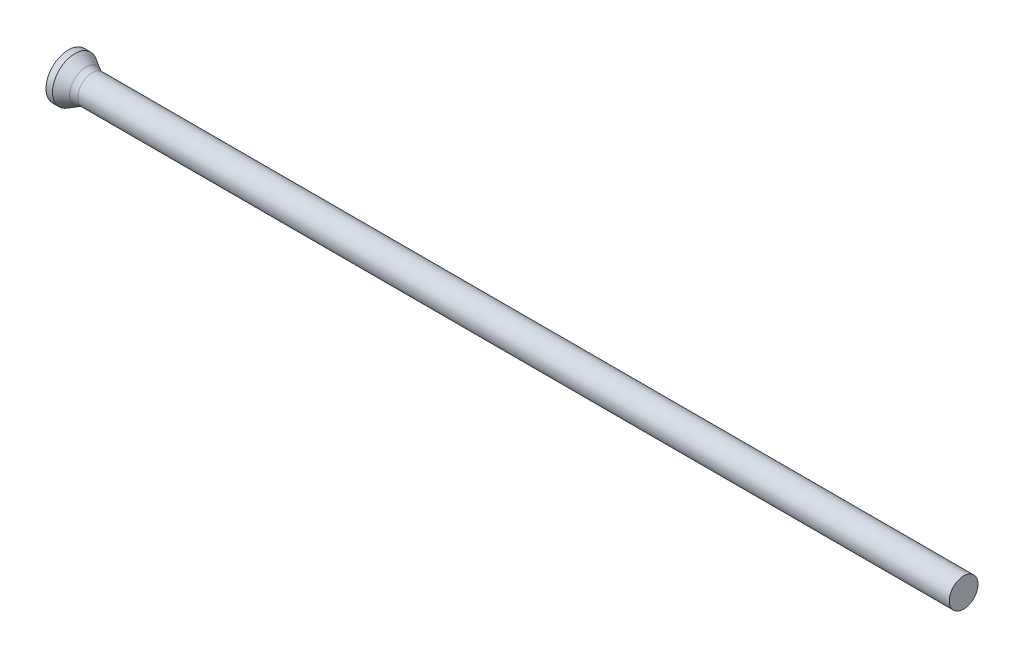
ISO-10303-21;
HEADER;
FILE_DESCRIPTION(('STEP AP214'),'2;1');
FILE_NAME('part.step','',(''),(''),'','','');
FILE_SCHEMA(('AUTOMOTIVE_DESIGN { 1 0 10303 214 1 1 1 1 }'));
ENDSEC;
DATA;
#1=APPLICATION_CONTEXT('core data for automotive mechanical design processes');
#2=APPLICATION_PROTOCOL_DEFINITION('international standard','automotive_design',2000,#1);
#3=PRODUCT_CONTEXT('',#1,'mechanical');
#4=PRODUCT('Part','Part','',(#3));
#5=PRODUCT_RELATED_PRODUCT_CATEGORY('part','',(#4));
#6=PRODUCT_DEFINITION_FORMATION('','',#4);
#7=PRODUCT_DEFINITION_CONTEXT('part definition',#1,'design');
#8=PRODUCT_DEFINITION('design','',#6,#7);
#9=PRODUCT_DEFINITION_SHAPE('','',#8);
#10=(LENGTH_UNIT() NAMED_UNIT(*) SI_UNIT(.MILLI.,.METRE.));
#11=(NAMED_UNIT(*) PLANE_ANGLE_UNIT() SI_UNIT($,.RADIAN.));
#12=(NAMED_UNIT(*) SI_UNIT($,.STERADIAN.) SOLID_ANGLE_UNIT());
#13=UNCERTAINTY_MEASURE_WITH_UNIT(LENGTH_MEASURE(1.E-05),#10,'distance_accuracy_value','');
#14=(GEOMETRIC_REPRESENTATION_CONTEXT(3) GLOBAL_UNCERTAINTY_ASSIGNED_CONTEXT((#13)) GLOBAL_UNIT_ASSIGNED_CONTEXT((#10,
#11,#12)) REPRESENTATION_CONTEXT('',''));
#15=CARTESIAN_POINT('',(0.,0.,0.));
#16=DIRECTION('',(0.,0.,1.));
#17=DIRECTION('',(1.,0.,0.));
#18=AXIS2_PLACEMENT_3D('',#15,#16,#17);
#19=CARTESIAN_POINT('',(0.,0.,0.));
#20=DIRECTION('',(1.,0.,0.));
#21=DIRECTION('',(0.,0.,-1.));
#22=AXIS2_PLACEMENT_3D('',#19,#20,#21);
#23=PLANE('',#22);
#24=CARTESIAN_POINT('',(0.,0.,0.));
#25=DIRECTION('',(-1.,0.,0.));
#26=DIRECTION('',(0.,0.,1.));
#27=AXIS2_PLACEMENT_3D('',#24,#25,#26);
#28=CIRCLE('',#27,1.75);
#29=CARTESIAN_POINT('',(0.,0.,1.75));
#30=VERTEX_POINT('',#29);
#31=EDGE_CURVE('E25',#30,#30,#28,.T.);
#32=ORIENTED_EDGE('',*,*,#31,.T.);
#33=EDGE_LOOP('',(#32));
#34=FACE_BOUND('',#33,.T.);
#35=ADVANCED_FACE('F14',(#34),#23,.F.);
#36=CARTESIAN_POINT('',(0.,0.,0.));
#37=DIRECTION('',(-1.,0.,0.));
#38=DIRECTION('',(0.,0.,1.));
#39=AXIS2_PLACEMENT_3D('',#36,#37,#38);
#40=CYLINDRICAL_SURFACE('',#39,1.75);
#41=ORIENTED_EDGE('',*,*,#31,.F.);
#42=EDGE_LOOP('',(#41));
#43=FACE_BOUND('',#42,.T.);
#44=CARTESIAN_POINT('',(0.507468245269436,0.,0.));
#45=DIRECTION('',(-1.,0.,0.));
#46=DIRECTION('',(0.,0.,1.));
#47=AXIS2_PLACEMENT_3D('',#44,#45,#46);
#48=CIRCLE('',#47,1.75);
#49=CARTESIAN_POINT('',(0.507468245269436,0.,1.75));
#50=VERTEX_POINT('',#49);
#51=EDGE_CURVE('E29',#50,#50,#48,.T.);
#52=ORIENTED_EDGE('',*,*,#51,.T.);
#53=EDGE_LOOP('',(#52));
#54=FACE_BOUND('',#53,.T.);
#55=ADVANCED_FACE('F53',(#43,#54),#40,.T.);
#56=CARTESIAN_POINT('',(1.59,0.,0.));
#57=DIRECTION('',(-1.,0.,0.));
#58=DIRECTION('',(0.,0.,1.));
#59=AXIS2_PLACEMENT_3D('',#56,#57,#58);
#60=CONICAL_SURFACE('',#59,1.125,0.523598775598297);
#61=CARTESIAN_POINT('',(1.35794919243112,0.,0.));
#62=DIRECTION('',(-1.,0.,0.));
#63=DIRECTION('',(0.,0.,1.));
#64=AXIS2_PLACEMENT_3D('',#61,#62,#63);
#65=CIRCLE('',#64,1.25897459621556);
#66=CARTESIAN_POINT('',(1.35794919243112,0.,1.25897459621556));
#67=VERTEX_POINT('',#66);
#68=EDGE_CURVE('E21',#67,#67,#65,.T.);
#69=ORIENTED_EDGE('',*,*,#68,.T.);
#70=EDGE_LOOP('',(#69));
#71=FACE_BOUND('',#70,.T.);
#72=ORIENTED_EDGE('',*,*,#51,.F.);
#73=EDGE_LOOP('',(#72));
#74=FACE_BOUND('',#73,.T.);
#75=ADVANCED_FACE('F50',(#71,#74),#60,.T.);
#76=CARTESIAN_POINT('',(0.,0.,0.));
#77=DIRECTION('',(-1.,0.,0.));
#78=DIRECTION('',(0.,0.,1.));
#79=AXIS2_PLACEMENT_3D('',#76,#77,#78);
#80=CYLINDRICAL_SURFACE('',#79,1.125);
#81=CARTESIAN_POINT('',(1.85794919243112,0.,0.));
#82=DIRECTION('',(-1.,0.,0.));
#83=DIRECTION('',(0.,0.,1.));
#84=AXIS2_PLACEMENT_3D('',#81,#82,#83);
#85=CIRCLE('',#84,1.125);
#86=CARTESIAN_POINT('',(1.85794919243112,0.,1.125));
#87=VERTEX_POINT('',#86);
#88=EDGE_CURVE('E9',#87,#87,#85,.F.);
#89=ORIENTED_EDGE('',*,*,#88,.T.);
#90=EDGE_LOOP('',(#89));
#91=FACE_BOUND('',#90,.T.);
#92=CARTESIAN_POINT('',(70.,0.,0.));
#93=DIRECTION('',(-1.,0.,0.));
#94=DIRECTION('',(0.,0.,1.));
#95=AXIS2_PLACEMENT_3D('',#92,#93,#94);
#96=CIRCLE('',#95,1.125);
#97=CARTESIAN_POINT('',(70.,0.,1.125));
#98=VERTEX_POINT('',#97);
#99=EDGE_CURVE('E34',#98,#98,#96,.T.);
#100=ORIENTED_EDGE('',*,*,#99,.T.);
#101=EDGE_LOOP('',(#100));
#102=FACE_BOUND('',#101,.T.);
#103=ADVANCED_FACE('F38',(#91,#102),#80,.T.);
#104=CARTESIAN_POINT('',(70.,1.125,0.));
#105=DIRECTION('',(-1.,0.,0.));
#106=DIRECTION('',(0.,0.,1.));
#107=AXIS2_PLACEMENT_3D('',#104,#105,#106);
#108=PLANE('',#107);
#109=ORIENTED_EDGE('',*,*,#99,.F.);
#110=EDGE_LOOP('',(#109));
#111=FACE_BOUND('',#110,.T.);
#112=ADVANCED_FACE('F40',(#111),#108,.F.);
#113=CARTESIAN_POINT('',(1.85794919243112,0.,0.));
#114=DIRECTION('',(-1.,0.,0.));
#115=DIRECTION('',(0.,0.,1.));
#116=AXIS2_PLACEMENT_3D('',#113,#114,#115);
#117=TOROIDAL_SURFACE('',#116,2.125,1.);
#118=ORIENTED_EDGE('',*,*,#88,.F.);
#119=EDGE_LOOP('',(#118));
#120=FACE_BOUND('',#119,.T.);
#121=ORIENTED_EDGE('',*,*,#68,.F.);
#122=EDGE_LOOP('',(#121));
#123=FACE_BOUND('',#122,.T.);
#124=ADVANCED_FACE('F16',(#120,#123),#117,.F.);
#125=CLOSED_SHELL('',(#35,#55,#75,#103,#112,#124));
#126=MANIFOLD_SOLID_BREP('B1',#125);
#127=ADVANCED_BREP_SHAPE_REPRESENTATION('',(#18,#126),#14);
#128=SHAPE_DEFINITION_REPRESENTATION(#9,#127);
ENDSEC;
END-ISO-10303-21;
